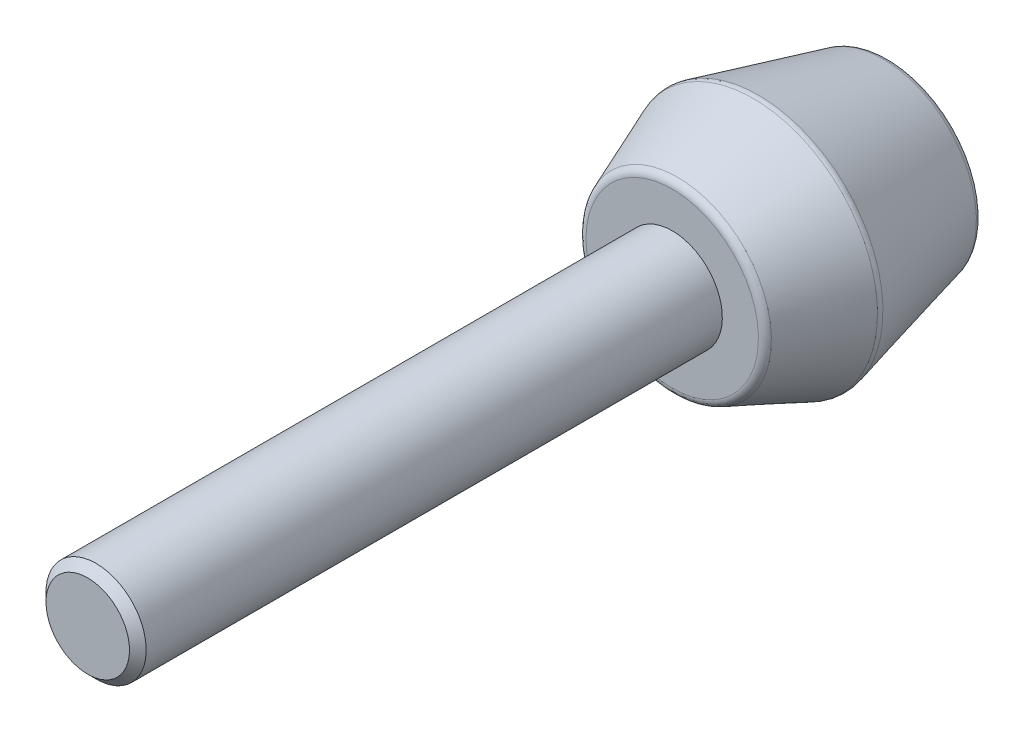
ISO-10303-21;
HEADER;
FILE_DESCRIPTION(('STEP AP214'),'2;1');
FILE_NAME('part.step','',(''),(''),'','','');
FILE_SCHEMA(('AUTOMOTIVE_DESIGN { 1 0 10303 214 1 1 1 1 }'));
ENDSEC;
DATA;
#1=APPLICATION_CONTEXT('core data for automotive mechanical design processes');
#2=APPLICATION_PROTOCOL_DEFINITION('international standard','automotive_design',2000,#1);
#3=PRODUCT_CONTEXT('',#1,'mechanical');
#4=PRODUCT('Part','Part','',(#3));
#5=PRODUCT_RELATED_PRODUCT_CATEGORY('part','',(#4));
#6=PRODUCT_DEFINITION_FORMATION('','',#4);
#7=PRODUCT_DEFINITION_CONTEXT('part definition',#1,'design');
#8=PRODUCT_DEFINITION('design','',#6,#7);
#9=PRODUCT_DEFINITION_SHAPE('','',#8);
#10=(LENGTH_UNIT() NAMED_UNIT(*) SI_UNIT(.MILLI.,.METRE.));
#11=(NAMED_UNIT(*) PLANE_ANGLE_UNIT() SI_UNIT($,.RADIAN.));
#12=(NAMED_UNIT(*) SI_UNIT($,.STERADIAN.) SOLID_ANGLE_UNIT());
#13=UNCERTAINTY_MEASURE_WITH_UNIT(LENGTH_MEASURE(1.E-05),#10,'distance_accuracy_value','');
#14=(GEOMETRIC_REPRESENTATION_CONTEXT(3) GLOBAL_UNCERTAINTY_ASSIGNED_CONTEXT((#13)) GLOBAL_UNIT_ASSIGNED_CONTEXT((#10,
#11,#12)) REPRESENTATION_CONTEXT('',''));
#15=CARTESIAN_POINT('',(0.,0.,0.));
#16=DIRECTION('',(0.,0.,1.));
#17=DIRECTION('',(1.,0.,0.));
#18=AXIS2_PLACEMENT_3D('',#15,#16,#17);
#19=CARTESIAN_POINT('',(0.,0.,12.5));
#20=DIRECTION('',(0.,0.,-1.));
#21=DIRECTION('',(0.769107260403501,-0.639119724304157,0.));
#22=AXIS2_PLACEMENT_3D('',#19,#20,#21);
#23=TOROIDAL_SURFACE('',#22,5.16148351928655,0.5);
#24=CARTESIAN_POINT('',(0.,0.,12.685695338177));
#25=DIRECTION('',(0.,0.,-1.));
#26=DIRECTION('',(0.769107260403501,-0.639119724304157,0.));
#27=AXIS2_PLACEMENT_3D('',#24,#25,#26);
#28=CIRCLE('',#27,5.62572186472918);
#29=CARTESIAN_POINT('',(4.32678353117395,-3.59550980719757,12.685695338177));
#30=VERTEX_POINT('',#29);
#31=EDGE_CURVE('E16',#30,#30,#28,.T.);
#32=ORIENTED_EDGE('',*,*,#31,.F.);
#33=EDGE_LOOP('',(#32));
#34=FACE_BOUND('',#33,.T.);
#35=CARTESIAN_POINT('',(0.,0.,13.));
#36=DIRECTION('',(0.,0.,1.));
#37=DIRECTION('',(0.769107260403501,-0.639119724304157,0.));
#38=AXIS2_PLACEMENT_3D('',#35,#36,#37);
#39=CIRCLE('',#38,5.16148351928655);
#40=CARTESIAN_POINT('',(3.96973444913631,-3.29880592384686,13.));
#41=VERTEX_POINT('',#40);
#42=EDGE_CURVE('E30',#41,#41,#39,.T.);
#43=ORIENTED_EDGE('',*,*,#42,.F.);
#44=EDGE_LOOP('',(#43));
#45=FACE_BOUND('',#44,.T.);
#46=ADVANCED_FACE('F12',(#34,#45),#23,.T.);
#47=CARTESIAN_POINT('',(0.,0.,7.96441803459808));
#48=DIRECTION('',(0.,0.,-1.));
#49=DIRECTION('',(0.769107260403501,-0.639119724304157,0.));
#50=AXIS2_PLACEMENT_3D('',#47,#48,#49);
#51=TOROIDAL_SURFACE('',#50,6.97571630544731,0.5);
#52=CARTESIAN_POINT('',(0.,0.,7.84315022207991));
#53=DIRECTION('',(0.,0.,-1.));
#54=DIRECTION('',(0.769107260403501,-0.639119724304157,0.));
#55=AXIS2_PLACEMENT_3D('',#52,#53,#54);
#56=CIRCLE('',#55,7.46078755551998);
#57=CARTESIAN_POINT('',(5.73814587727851,-4.7683364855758,7.84315022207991));
#58=VERTEX_POINT('',#57);
#59=EDGE_CURVE('E40',#58,#58,#56,.T.);
#60=ORIENTED_EDGE('',*,*,#59,.F.);
#61=EDGE_LOOP('',(#60));
#62=FACE_BOUND('',#61,.T.);
#63=CARTESIAN_POINT('',(0.,0.,8.15011337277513));
#64=DIRECTION('',(0.,0.,1.));
#65=DIRECTION('',(-0.769107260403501,0.639119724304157,0.));
#66=AXIS2_PLACEMENT_3D('',#63,#64,#65);
#67=CIRCLE('',#66,7.43995465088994);
#68=CARTESIAN_POINT('',(-5.72212313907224,4.75502176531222,8.15011337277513));
#69=VERTEX_POINT('',#68);
#70=EDGE_CURVE('E35',#69,#69,#67,.T.);
#71=ORIENTED_EDGE('',*,*,#70,.F.);
#72=EDGE_LOOP('',(#71));
#73=FACE_BOUND('',#72,.T.);
#74=ADVANCED_FACE('F14',(#62,#73),#51,.T.);
#75=CARTESIAN_POINT('',(0.,0.,0.5));
#76=DIRECTION('',(0.,0.,-1.));
#77=DIRECTION('',(0.769107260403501,-0.639119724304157,0.));
#78=AXIS2_PLACEMENT_3D('',#75,#76,#77);
#79=TOROIDAL_SURFACE('',#78,5.10961179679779,0.5);
#80=CARTESIAN_POINT('',(0.,0.,0.));
#81=DIRECTION('',(0.,0.,-1.));
#82=DIRECTION('',(0.769107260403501,-0.639119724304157,0.));
#83=AXIS2_PLACEMENT_3D('',#80,#81,#82);
#84=CIRCLE('',#83,5.10961179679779);
#85=CARTESIAN_POINT('',(3.92983953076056,-3.26565368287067,0.));
#86=VERTEX_POINT('',#85);
#87=EDGE_CURVE('E34',#86,#86,#84,.T.);
#88=ORIENTED_EDGE('',*,*,#87,.F.);
#89=EDGE_LOOP('',(#88));
#90=FACE_BOUND('',#89,.T.);
#91=CARTESIAN_POINT('',(0.,0.,0.378732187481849));
#92=DIRECTION('',(0.,0.,1.));
#93=DIRECTION('',(0.769107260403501,-0.639119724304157,0.));
#94=AXIS2_PLACEMENT_3D('',#91,#92,#93);
#95=CIRCLE('',#94,5.59468304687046);
#96=CARTESIAN_POINT('',(4.30291135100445,-3.57567228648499,0.378732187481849));
#97=VERTEX_POINT('',#96);
#98=EDGE_CURVE('E39',#97,#97,#95,.T.);
#99=ORIENTED_EDGE('',*,*,#98,.F.);
#100=EDGE_LOOP('',(#99));
#101=FACE_BOUND('',#100,.T.);
#102=ADVANCED_FACE('F56',(#90,#101),#79,.T.);
#103=CARTESIAN_POINT('',(0.,0.,13.));
#104=DIRECTION('',(0.,0.,-1.));
#105=DIRECTION('',(0.769107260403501,-0.639119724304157,0.));
#106=AXIS2_PLACEMENT_3D('',#103,#104,#105);
#107=CONICAL_SURFACE('',#106,5.5,0.380506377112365);
#108=ORIENTED_EDGE('',*,*,#70,.T.);
#109=EDGE_LOOP('',(#108));
#110=FACE_BOUND('',#109,.T.);
#111=ORIENTED_EDGE('',*,*,#31,.T.);
#112=EDGE_LOOP('',(#111));
#113=FACE_BOUND('',#112,.T.);
#114=ADVANCED_FACE('F58',(#110,#113),#107,.T.);
#115=CARTESIAN_POINT('',(0.,0.,0.));
#116=DIRECTION('',(0.,0.,1.));
#117=DIRECTION('',(-0.769107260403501,0.639119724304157,0.));
#118=AXIS2_PLACEMENT_3D('',#115,#116,#117);
#119=CONICAL_SURFACE('',#118,5.5,0.244978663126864);
#120=ORIENTED_EDGE('',*,*,#59,.T.);
#121=EDGE_LOOP('',(#120));
#122=FACE_BOUND('',#121,.T.);
#123=ORIENTED_EDGE('',*,*,#98,.T.);
#124=EDGE_LOOP('',(#123));
#125=FACE_BOUND('',#124,.T.);
#126=ADVANCED_FACE('F54',(#122,#125),#119,.T.);
#127=CARTESIAN_POINT('',(0.,0.,0.));
#128=DIRECTION('',(0.,0.,-1.));
#129=DIRECTION('',(0.769107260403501,-0.639119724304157,0.));
#130=AXIS2_PLACEMENT_3D('',#127,#128,#129);
#131=PLANE('',#130);
#132=ORIENTED_EDGE('',*,*,#87,.T.);
#133=EDGE_LOOP('',(#132));
#134=FACE_BOUND('',#133,.T.);
#135=ADVANCED_FACE('F87',(#134),#131,.T.);
#136=CARTESIAN_POINT('',(0.,0.,13.));
#137=DIRECTION('',(0.,0.,-1.));
#138=DIRECTION('',(0.769107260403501,-0.639119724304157,0.));
#139=AXIS2_PLACEMENT_3D('',#136,#137,#138);
#140=PLANE('',#139);
#141=CARTESIAN_POINT('',(0.,0.,13.));
#142=DIRECTION('',(0.,0.,-1.));
#143=DIRECTION('',(0.,1.,0.));
#144=AXIS2_PLACEMENT_3D('',#141,#142,#143);
#145=CIRCLE('',#144,3.);
#146=CARTESIAN_POINT('',(0.,3.00000000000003,13.));
#147=VERTEX_POINT('',#146);
#148=EDGE_CURVE('E8',#147,#147,#145,.F.);
#149=ORIENTED_EDGE('',*,*,#148,.F.);
#150=EDGE_LOOP('',(#149));
#151=FACE_BOUND('',#150,.T.);
#152=ORIENTED_EDGE('',*,*,#42,.T.);
#153=EDGE_LOOP('',(#152));
#154=FACE_BOUND('',#153,.T.);
#155=ADVANCED_FACE('F76',(#151,#154),#140,.F.);
#156=CARTESIAN_POINT('',(0.,0.,48.));
#157=DIRECTION('',(0.,0.,-1.));
#158=DIRECTION('',(0.584878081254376,0.811121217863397,0.));
#159=AXIS2_PLACEMENT_3D('',#156,#157,#158);
#160=PLANE('',#159);
#161=CARTESIAN_POINT('',(0.,0.,48.));
#162=DIRECTION('',(0.,0.,1.));
#163=DIRECTION('',(0.584878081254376,0.811121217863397,0.));
#164=AXIS2_PLACEMENT_3D('',#161,#162,#163);
#165=CIRCLE('',#164,2.5);
#166=CARTESIAN_POINT('',(1.46219520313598,2.02780304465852,48.));
#167=VERTEX_POINT('',#166);
#168=EDGE_CURVE('E26',#167,#167,#165,.T.);
#169=ORIENTED_EDGE('',*,*,#168,.T.);
#170=EDGE_LOOP('',(#169));
#171=FACE_BOUND('',#170,.T.);
#172=ADVANCED_FACE('F73',(#171),#160,.F.);
#173=CARTESIAN_POINT('',(0.,0.,47.5));
#174=DIRECTION('',(0.,0.,-1.));
#175=DIRECTION('',(0.584878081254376,0.811121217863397,0.));
#176=AXIS2_PLACEMENT_3D('',#173,#174,#175);
#177=CONICAL_SURFACE('',#176,3.,0.785398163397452);
#178=CARTESIAN_POINT('',(0.,0.,47.5));
#179=DIRECTION('',(0.,0.,-1.));
#180=DIRECTION('',(0.584878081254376,0.811121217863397,0.));
#181=AXIS2_PLACEMENT_3D('',#178,#179,#180);
#182=CIRCLE('',#181,3.);
#183=CARTESIAN_POINT('',(1.75463424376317,2.43336365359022,47.5));
#184=VERTEX_POINT('',#183);
#185=EDGE_CURVE('E20',#184,#184,#182,.T.);
#186=ORIENTED_EDGE('',*,*,#185,.F.);
#187=EDGE_LOOP('',(#186));
#188=FACE_BOUND('',#187,.T.);
#189=ORIENTED_EDGE('',*,*,#168,.F.);
#190=EDGE_LOOP('',(#189));
#191=FACE_BOUND('',#190,.T.);
#192=ADVANCED_FACE('F75',(#188,#191),#177,.T.);
#193=CARTESIAN_POINT('',(0.,0.,1.));
#194=DIRECTION('',(0.,0.,1.));
#195=DIRECTION('',(-0.584878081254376,-0.811121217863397,0.));
#196=AXIS2_PLACEMENT_3D('',#193,#194,#195);
#197=CYLINDRICAL_SURFACE('',#196,3.);
#198=ORIENTED_EDGE('',*,*,#185,.T.);
#199=EDGE_LOOP('',(#198));
#200=FACE_BOUND('',#199,.T.);
#201=ORIENTED_EDGE('',*,*,#148,.T.);
#202=EDGE_LOOP('',(#201));
#203=FACE_BOUND('',#202,.T.);
#204=ADVANCED_FACE('F84',(#200,#203),#197,.T.);
#205=CLOSED_SHELL('',(#46,#74,#102,#114,#126,#135,#155,#172,#192,#204));
#206=MANIFOLD_SOLID_BREP('B1',#205);
#207=ADVANCED_BREP_SHAPE_REPRESENTATION('',(#18,#206),#14);
#208=SHAPE_DEFINITION_REPRESENTATION(#9,#207);
ENDSEC;
END-ISO-10303-21;
